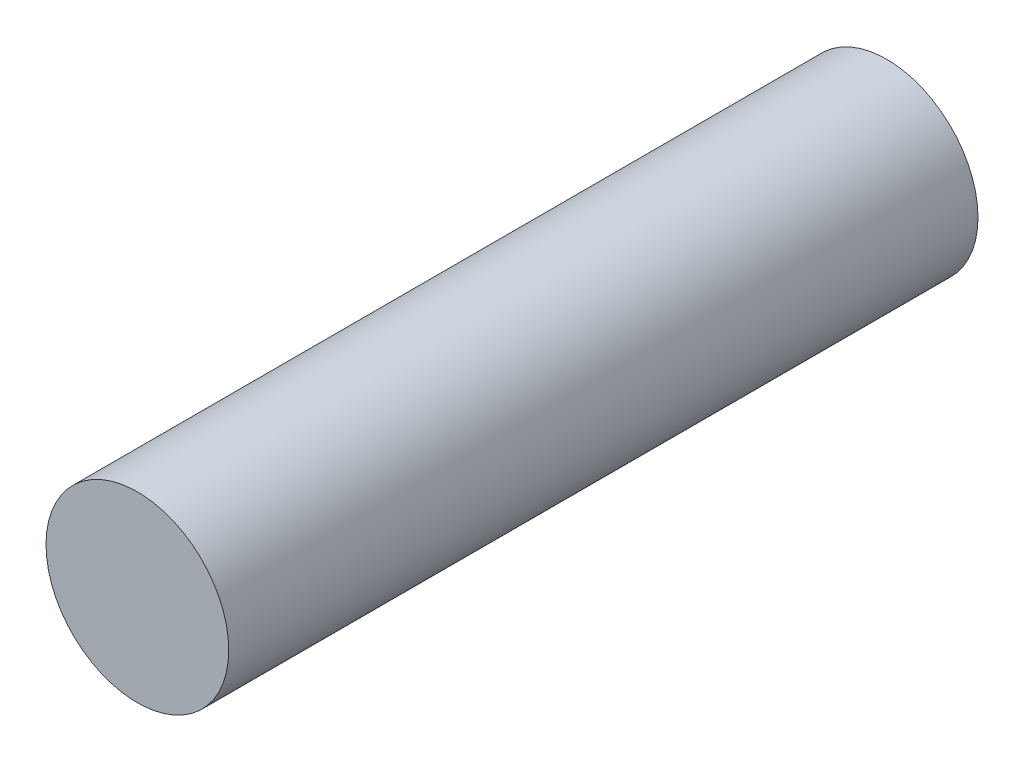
ISO-10303-21;
HEADER;
FILE_DESCRIPTION(('STEP AP214'),'2;1');
FILE_NAME('part.step','',(''),(''),'','','');
FILE_SCHEMA(('AUTOMOTIVE_DESIGN { 1 0 10303 214 1 1 1 1 }'));
ENDSEC;
DATA;
#1=APPLICATION_CONTEXT('core data for automotive mechanical design processes');
#2=APPLICATION_PROTOCOL_DEFINITION('international standard','automotive_design',2000,#1);
#3=PRODUCT_CONTEXT('',#1,'mechanical');
#4=PRODUCT('Part','Part','',(#3));
#5=PRODUCT_RELATED_PRODUCT_CATEGORY('part','',(#4));
#6=PRODUCT_DEFINITION_FORMATION('','',#4);
#7=PRODUCT_DEFINITION_CONTEXT('part definition',#1,'design');
#8=PRODUCT_DEFINITION('design','',#6,#7);
#9=PRODUCT_DEFINITION_SHAPE('','',#8);
#10=(LENGTH_UNIT() NAMED_UNIT(*) SI_UNIT(.MILLI.,.METRE.));
#11=(NAMED_UNIT(*) PLANE_ANGLE_UNIT() SI_UNIT($,.RADIAN.));
#12=(NAMED_UNIT(*) SI_UNIT($,.STERADIAN.) SOLID_ANGLE_UNIT());
#13=UNCERTAINTY_MEASURE_WITH_UNIT(LENGTH_MEASURE(1.E-05),#10,'distance_accuracy_value','');
#14=(GEOMETRIC_REPRESENTATION_CONTEXT(3) GLOBAL_UNCERTAINTY_ASSIGNED_CONTEXT((#13)) GLOBAL_UNIT_ASSIGNED_CONTEXT((#10,
#11,#12)) REPRESENTATION_CONTEXT('',''));
#15=CARTESIAN_POINT('',(0.,0.,0.));
#16=DIRECTION('',(0.,0.,1.));
#17=DIRECTION('',(1.,0.,0.));
#18=AXIS2_PLACEMENT_3D('',#15,#16,#17);
#19=CARTESIAN_POINT('',(0.,0.,77.));
#20=DIRECTION('',(0.,0.,-1.));
#21=DIRECTION('',(-1.,0.,0.));
#22=AXIS2_PLACEMENT_3D('',#19,#20,#21);
#23=CYLINDRICAL_SURFACE('',#22,9.39);
#24=CARTESIAN_POINT('',(0.,0.,77.));
#25=DIRECTION('',(0.,0.,1.));
#26=DIRECTION('',(1.,0.,0.));
#27=AXIS2_PLACEMENT_3D('',#24,#25,#26);
#28=CIRCLE('',#27,9.39);
#29=CARTESIAN_POINT('',(9.39,0.,77.));
#30=VERTEX_POINT('',#29);
#31=EDGE_CURVE('E11',#30,#30,#28,.T.);
#32=ORIENTED_EDGE('',*,*,#31,.F.);
#33=EDGE_LOOP('',(#32));
#34=FACE_BOUND('',#33,.T.);
#35=CARTESIAN_POINT('',(0.,0.,0.));
#36=DIRECTION('',(0.,0.,1.));
#37=DIRECTION('',(1.,0.,0.));
#38=AXIS2_PLACEMENT_3D('',#35,#36,#37);
#39=CIRCLE('',#38,9.39);
#40=CARTESIAN_POINT('',(9.39,0.,0.));
#41=VERTEX_POINT('',#40);
#42=EDGE_CURVE('E36',#41,#41,#39,.T.);
#43=ORIENTED_EDGE('',*,*,#42,.T.);
#44=EDGE_LOOP('',(#43));
#45=FACE_BOUND('',#44,.T.);
#46=ADVANCED_FACE('F30',(#34,#45),#23,.T.);
#47=CARTESIAN_POINT('',(0.,0.,77.));
#48=DIRECTION('',(0.,0.,1.));
#49=DIRECTION('',(1.,0.,0.));
#50=AXIS2_PLACEMENT_3D('',#47,#48,#49);
#51=PLANE('',#50);
#52=ORIENTED_EDGE('',*,*,#31,.T.);
#53=EDGE_LOOP('',(#52));
#54=FACE_BOUND('',#53,.T.);
#55=ADVANCED_FACE('F58',(#54),#51,.T.);
#56=CARTESIAN_POINT('',(0.,0.,0.));
#57=DIRECTION('',(0.,0.,1.));
#58=DIRECTION('',(1.,0.,0.));
#59=AXIS2_PLACEMENT_3D('',#56,#57,#58);
#60=PLANE('',#59);
#61=CARTESIAN_POINT('',(0.,0.,0.));
#62=DIRECTION('',(0.,0.,-1.));
#63=DIRECTION('',(-1.,0.,0.));
#64=AXIS2_PLACEMENT_3D('',#61,#62,#63);
#65=CIRCLE('',#64,3.99999999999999);
#66=CARTESIAN_POINT('',(-3.99999999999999,0.,0.));
#67=VERTEX_POINT('',#66);
#68=EDGE_CURVE('E48',#67,#67,#65,.T.);
#69=ORIENTED_EDGE('',*,*,#68,.F.);
#70=EDGE_LOOP('',(#69));
#71=FACE_BOUND('',#70,.T.);
#72=ORIENTED_EDGE('',*,*,#42,.F.);
#73=EDGE_LOOP('',(#72));
#74=FACE_BOUND('',#73,.T.);
#75=ADVANCED_FACE('F56',(#71,#74),#60,.F.);
#76=CARTESIAN_POINT('',(0.,0.,0.));
#77=DIRECTION('',(0.,0.,-1.));
#78=DIRECTION('',(-1.,0.,0.));
#79=AXIS2_PLACEMENT_3D('',#76,#77,#78);
#80=CYLINDRICAL_SURFACE('',#79,3.99999999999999);
#81=CARTESIAN_POINT('',(0.,0.,51.));
#82=DIRECTION('',(0.,0.,-1.));
#83=DIRECTION('',(-1.,0.,0.));
#84=AXIS2_PLACEMENT_3D('',#81,#82,#83);
#85=CIRCLE('',#84,3.99999999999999);
#86=CARTESIAN_POINT('',(-3.99999999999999,0.,51.));
#87=VERTEX_POINT('',#86);
#88=EDGE_CURVE('E46',#87,#87,#85,.T.);
#89=ORIENTED_EDGE('',*,*,#88,.F.);
#90=EDGE_LOOP('',(#89));
#91=FACE_BOUND('',#90,.T.);
#92=ORIENTED_EDGE('',*,*,#68,.T.);
#93=EDGE_LOOP('',(#92));
#94=FACE_BOUND('',#93,.T.);
#95=ADVANCED_FACE('F42',(#91,#94),#80,.F.);
#96=CARTESIAN_POINT('',(0.,0.,51.));
#97=DIRECTION('',(0.,0.,-1.));
#98=DIRECTION('',(-1.,0.,0.));
#99=AXIS2_PLACEMENT_3D('',#96,#97,#98);
#100=CONICAL_SURFACE('',#99,3.99999999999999,1.04719755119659);
#101=CARTESIAN_POINT('',(0.,0.,53.3094010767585));
#102=VERTEX_POINT('',#101);
#103=VERTEX_LOOP('',#102);
#104=FACE_BOUND('',#103,.T.);
#105=ORIENTED_EDGE('',*,*,#88,.T.);
#106=EDGE_LOOP('',(#105));
#107=FACE_BOUND('',#106,.T.);
#108=ADVANCED_FACE('F39',(#104,#107),#100,.F.);
#109=CLOSED_SHELL('',(#46,#55,#75,#95,#108));
#110=MANIFOLD_SOLID_BREP('B2',#109);
#111=ADVANCED_BREP_SHAPE_REPRESENTATION('',(#18,#110),#14);
#112=SHAPE_DEFINITION_REPRESENTATION(#9,#111);
ENDSEC;
END-ISO-10303-21;
